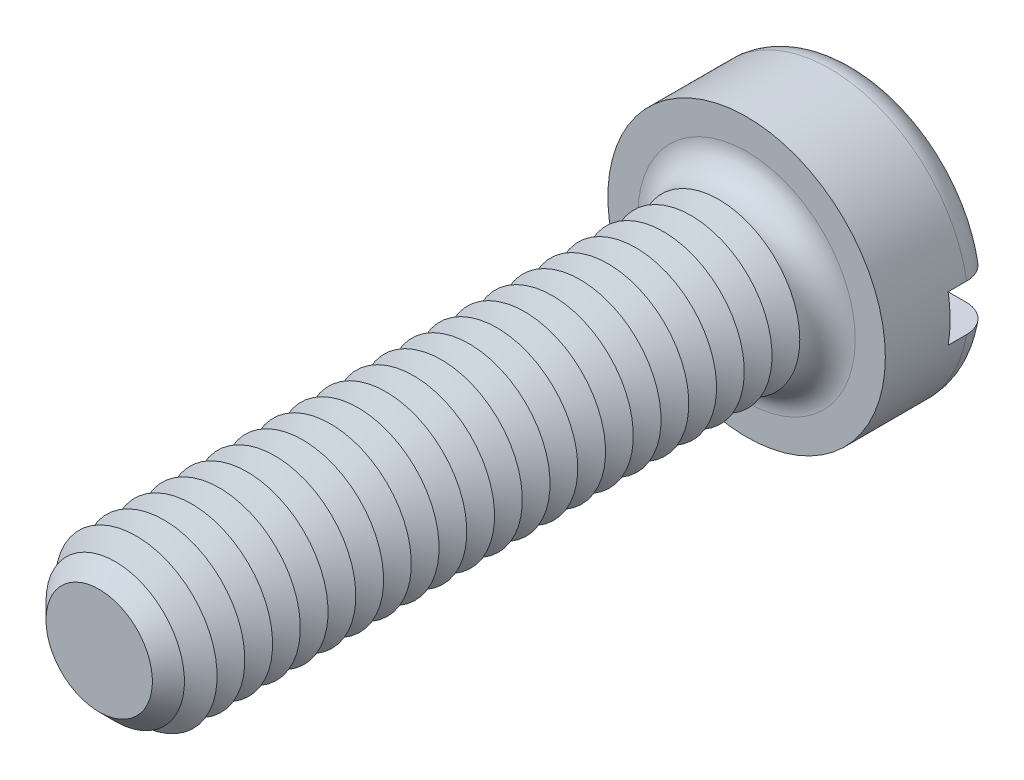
from build123d import *

# Parameters (mm, degrees)
SKETCH3_R           = 3
BOSS_EXTRUDE2_DEPTH = 2.4
SKETCH4_R           = 1.75
BOSS_EXTRUDE3_DEPTH = 14
FILLET1_R           = 0.6
CHAMFER1_SIZE       = 0.6
LPATTERN1_COUNT     = 22
LPATTERN1_PITCH     = 0.6
SKETCH8_W           = 6
SKETCH8_H           = 1
CUT_EXTRUDE1_DEPTH  = 1


with BuildPart() as part:
    # Sketch3 → Boss-Extrude2 (new body)
    with BuildSketch(Plane.XY):
        Circle(SKETCH3_R)
    extrude(amount=-BOSS_EXTRUDE2_DEPTH)

    # Sketch4 → Boss-Extrude3 (add)
    with BuildSketch(Plane.XY):
        Circle(SKETCH4_R)
    extrude(amount=BOSS_EXTRUDE3_DEPTH)

    # Fillet1
    fillet1_edges = [part.edges().sort_by_distance(p)[0] for p in [
        (-3, 0, -2.4),
        (-1.75, 0, 0),
    ]]
    fillet(fillet1_edges, radius=FILLET1_R)

    # Chamfer1
    chamfer1_edges = [part.edges().sort_by_distance(p)[0] for p in [
        (-1.75, 0, 14),
    ]]
    chamfer(chamfer1_edges, length=CHAMFER1_SIZE)

    # Sketch6 → Cut-Revolve1 (revolve, cut)
    with BuildSketch(Plane(origin=(0, 0, 0), x_dir=(0, 0, -1), z_dir=(1, 0, 0)), mode=Mode.PRIVATE) as cut_revolve1_sk:
        Polygon((-0.6, 1.75), (-0.9, 1.230384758), (-1.2, 1.75), align=None)
    cut_revolve1 = revolve(cut_revolve1_sk.sketch.rotate(Axis((0, 0, -1.694361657), (0, 0, 1)), 90), axis=Axis((0, 0, -1.694361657), (0, 0, 1)), mode=Mode.SUBTRACT)

    # LPattern1: Cut-Revolve1 ×22
    with Locations(*[(0, 0, i * LPATTERN1_PITCH) for i in range(1, LPATTERN1_COUNT)]):
        add(cut_revolve1, mode=Mode.SUBTRACT)

    # Sketch8 → Cut-Extrude1 (cut)
    with BuildSketch(Plane(origin=(0, 0, -2.4), x_dir=(-1, 0, 0), z_dir=(0, 0, -1))):
        Rectangle(SKETCH8_W, SKETCH8_H)
    extrude(amount=-CUT_EXTRUDE1_DEPTH, mode=Mode.SUBTRACT)


solid = part.part
